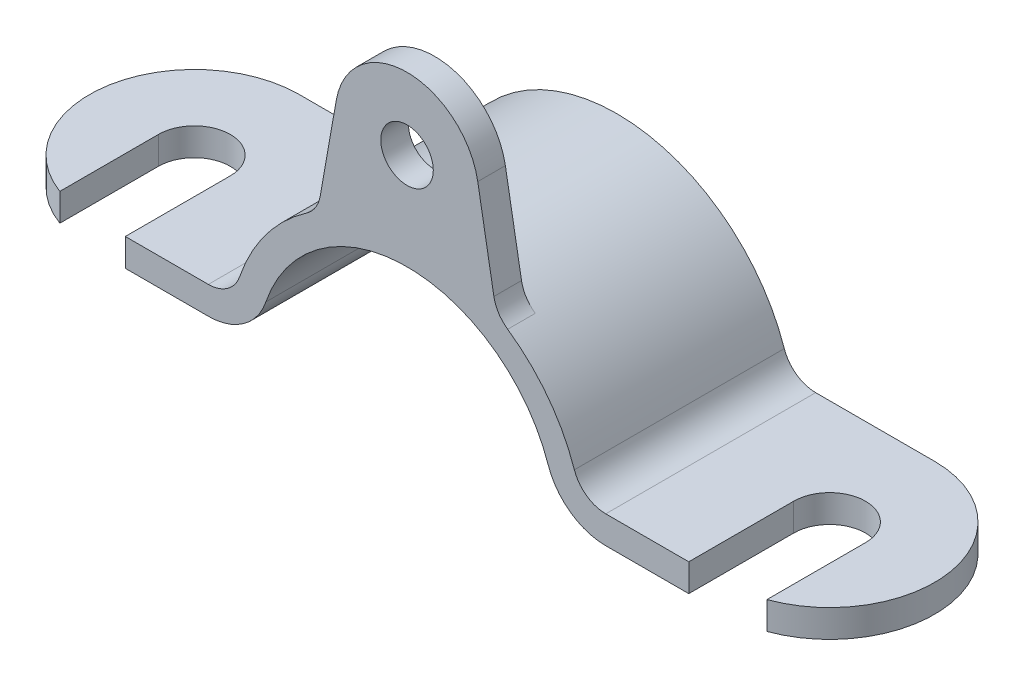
ISO-10303-21;
HEADER;
FILE_DESCRIPTION(('STEP AP214'),'2;1');
FILE_NAME('part.step','',(''),(''),'','','');
FILE_SCHEMA(('AUTOMOTIVE_DESIGN { 1 0 10303 214 1 1 1 1 }'));
ENDSEC;
DATA;
#1=APPLICATION_CONTEXT('core data for automotive mechanical design processes');
#2=APPLICATION_PROTOCOL_DEFINITION('international standard','automotive_design',2000,#1);
#3=PRODUCT_CONTEXT('',#1,'mechanical');
#4=PRODUCT('Part','Part','',(#3));
#5=PRODUCT_RELATED_PRODUCT_CATEGORY('part','',(#4));
#6=PRODUCT_DEFINITION_FORMATION('','',#4);
#7=PRODUCT_DEFINITION_CONTEXT('part definition',#1,'design');
#8=PRODUCT_DEFINITION('design','',#6,#7);
#9=PRODUCT_DEFINITION_SHAPE('','',#8);
#10=(LENGTH_UNIT() NAMED_UNIT(*) SI_UNIT(.MILLI.,.METRE.));
#11=(NAMED_UNIT(*) PLANE_ANGLE_UNIT() SI_UNIT($,.RADIAN.));
#12=(NAMED_UNIT(*) SI_UNIT($,.STERADIAN.) SOLID_ANGLE_UNIT());
#13=UNCERTAINTY_MEASURE_WITH_UNIT(LENGTH_MEASURE(1.E-05),#10,'distance_accuracy_value','');
#14=(GEOMETRIC_REPRESENTATION_CONTEXT(3) GLOBAL_UNCERTAINTY_ASSIGNED_CONTEXT((#13)) GLOBAL_UNIT_ASSIGNED_CONTEXT((#10,
#11,#12)) REPRESENTATION_CONTEXT('',''));
#15=CARTESIAN_POINT('',(0.,0.,0.));
#16=DIRECTION('',(0.,0.,1.));
#17=DIRECTION('',(1.,0.,0.));
#18=AXIS2_PLACEMENT_3D('',#15,#16,#17);
#19=CARTESIAN_POINT('',(57.5,-6.25,-19.));
#20=DIRECTION('',(0.,1.,0.));
#21=DIRECTION('',(-1.,0.,0.));
#22=AXIS2_PLACEMENT_3D('',#19,#20,#21);
#23=CYLINDRICAL_SURFACE('',#22,19.);
#24=DIRECTION('',(0.,1.,0.));
#25=VECTOR('',#24,1.);
#26=CARTESIAN_POINT('',(64.,-6.25,-1.14642892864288));
#27=LINE('',#26,#25);
#28=CARTESIAN_POINT('',(64.,1.25,-1.14642892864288));
#29=VERTEX_POINT('',#28);
#30=CARTESIAN_POINT('',(64.,6.25,-1.14642892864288));
#31=VERTEX_POINT('',#30);
#32=EDGE_CURVE('E224',#29,#31,#27,.T.);
#33=ORIENTED_EDGE('',*,*,#32,.F.);
#34=CARTESIAN_POINT('',(57.5,1.25,-19.));
#35=DIRECTION('',(0.,1.,0.));
#36=DIRECTION('',(0.,0.,1.));
#37=AXIS2_PLACEMENT_3D('',#34,#35,#36);
#38=CIRCLE('',#37,19.);
#39=CARTESIAN_POINT('',(57.5,1.25,-38.));
#40=VERTEX_POINT('',#39);
#41=EDGE_CURVE('E244',#40,#29,#38,.F.);
#42=ORIENTED_EDGE('',*,*,#41,.F.);
#43=DIRECTION('',(0.,-1.,0.));
#44=VECTOR('',#43,1.);
#45=CARTESIAN_POINT('',(57.5,-6.25,-38.));
#46=LINE('',#45,#44);
#47=CARTESIAN_POINT('',(57.5,6.25,-38.));
#48=VERTEX_POINT('',#47);
#49=EDGE_CURVE('E247',#48,#40,#46,.T.);
#50=ORIENTED_EDGE('',*,*,#49,.F.);
#51=CARTESIAN_POINT('',(57.5,6.25,-19.));
#52=DIRECTION('',(0.,1.,0.));
#53=DIRECTION('',(0.,0.,1.));
#54=AXIS2_PLACEMENT_3D('',#51,#52,#53);
#55=CIRCLE('',#54,19.);
#56=EDGE_CURVE('E275',#31,#48,#55,.T.);
#57=ORIENTED_EDGE('',*,*,#56,.F.);
#58=EDGE_LOOP('',(#33,#42,#50,#57));
#59=FACE_BOUND('',#58,.T.);
#60=ADVANCED_FACE('F34',(#59),#23,.T.);
#61=CARTESIAN_POINT('',(0.,0.,-38.));
#62=DIRECTION('',(0.,0.,1.));
#63=DIRECTION('',(1.,0.,0.));
#64=AXIS2_PLACEMENT_3D('',#61,#62,#63);
#65=PLANE('',#64);
#66=CARTESIAN_POINT('',(-35.9713427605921,12.25,-38.));
#67=DIRECTION('',(0.,0.,-1.));
#68=DIRECTION('',(1.,0.,0.));
#69=AXIS2_PLACEMENT_3D('',#66,#67,#68);
#70=CIRCLE('',#69,11.);
#71=CARTESIAN_POINT('',(-25.5585856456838,8.70394736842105,-38.));
#72=VERTEX_POINT('',#71);
#73=CARTESIAN_POINT('',(-35.9713427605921,1.25,-38.));
#74=VERTEX_POINT('',#73);
#75=EDGE_CURVE('E240',#72,#74,#70,.T.);
#76=ORIENTED_EDGE('',*,*,#75,.T.);
#77=DIRECTION('',(-1.,0.,0.));
#78=VECTOR('',#77,1.);
#79=CARTESIAN_POINT('',(-35.9713427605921,1.25,-38.));
#80=LINE('',#79,#78);
#81=CARTESIAN_POINT('',(-57.5,1.25,-38.));
#82=VERTEX_POINT('',#81);
#83=EDGE_CURVE('E360',#74,#82,#80,.T.);
#84=ORIENTED_EDGE('',*,*,#83,.T.);
#85=DIRECTION('',(0.,1.,0.));
#86=VECTOR('',#85,1.);
#87=CARTESIAN_POINT('',(-57.5,6.25,-38.));
#88=LINE('',#87,#86);
#89=CARTESIAN_POINT('',(-57.5,6.25,-38.));
#90=VERTEX_POINT('',#89);
#91=EDGE_CURVE('E254',#82,#90,#88,.T.);
#92=ORIENTED_EDGE('',*,*,#91,.T.);
#93=DIRECTION('',(-1.,0.,0.));
#94=VECTOR('',#93,1.);
#95=CARTESIAN_POINT('',(-31.3837139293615,6.25,-38.));
#96=LINE('',#95,#94);
#97=CARTESIAN_POINT('',(-35.9713427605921,6.25,-38.));
#98=VERTEX_POINT('',#97);
#99=EDGE_CURVE('E279',#98,#90,#96,.T.);
#100=ORIENTED_EDGE('',*,*,#99,.F.);
#101=CARTESIAN_POINT('',(-35.9713427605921,12.25,-38.));
#102=DIRECTION('',(0.,0.,1.));
#103=DIRECTION('',(1.,0.,0.));
#104=AXIS2_PLACEMENT_3D('',#101,#102,#103);
#105=CIRCLE('',#104,6.);
#106=CARTESIAN_POINT('',(-30.2916570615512,10.3157894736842,-38.));
#107=VERTEX_POINT('',#106);
#108=EDGE_CURVE('E248',#98,#107,#105,.T.);
#109=ORIENTED_EDGE('',*,*,#108,.T.);
#110=CARTESIAN_POINT('',(0.,0.,-38.));
#111=DIRECTION('',(0.,0.,1.));
#112=DIRECTION('',(1.,0.,0.));
#113=AXIS2_PLACEMENT_3D('',#110,#111,#112);
#114=CIRCLE('',#113,32.);
#115=CARTESIAN_POINT('',(30.2916570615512,10.3157894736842,-38.));
#116=VERTEX_POINT('',#115);
#117=EDGE_CURVE('E295',#116,#107,#114,.T.);
#118=ORIENTED_EDGE('',*,*,#117,.F.);
#119=CARTESIAN_POINT('',(35.9713427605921,12.25,-38.));
#120=DIRECTION('',(0.,0.,1.));
#121=DIRECTION('',(1.,0.,0.));
#122=AXIS2_PLACEMENT_3D('',#119,#120,#121);
#123=CIRCLE('',#122,6.);
#124=CARTESIAN_POINT('',(35.9713427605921,6.25,-38.));
#125=VERTEX_POINT('',#124);
#126=EDGE_CURVE('E245',#116,#125,#123,.T.);
#127=ORIENTED_EDGE('',*,*,#126,.T.);
#128=DIRECTION('',(-1.,0.,0.));
#129=VECTOR('',#128,1.);
#130=CARTESIAN_POINT('',(31.3837139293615,6.25,-38.));
#131=LINE('',#130,#129);
#132=EDGE_CURVE('E276',#48,#125,#131,.T.);
#133=ORIENTED_EDGE('',*,*,#132,.F.);
#134=ORIENTED_EDGE('',*,*,#49,.T.);
#135=DIRECTION('',(-1.,0.,0.));
#136=VECTOR('',#135,1.);
#137=CARTESIAN_POINT('',(76.5,1.25,-38.));
#138=LINE('',#137,#136);
#139=CARTESIAN_POINT('',(35.9713427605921,1.25,-38.));
#140=VERTEX_POINT('',#139);
#141=EDGE_CURVE('E370',#40,#140,#138,.T.);
#142=ORIENTED_EDGE('',*,*,#141,.T.);
#143=CARTESIAN_POINT('',(35.9713427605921,12.25,-38.));
#144=DIRECTION('',(0.,0.,-1.));
#145=DIRECTION('',(1.,0.,0.));
#146=AXIS2_PLACEMENT_3D('',#143,#144,#145);
#147=CIRCLE('',#146,11.);
#148=CARTESIAN_POINT('',(25.5585856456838,8.70394736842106,-38.));
#149=VERTEX_POINT('',#148);
#150=EDGE_CURVE('E367',#140,#149,#147,.T.);
#151=ORIENTED_EDGE('',*,*,#150,.T.);
#152=CARTESIAN_POINT('',(0.,0.,-38.));
#153=DIRECTION('',(0.,0.,1.));
#154=DIRECTION('',(1.,0.,0.));
#155=AXIS2_PLACEMENT_3D('',#152,#153,#154);
#156=CIRCLE('',#155,27.);
#157=EDGE_CURVE('E305',#149,#72,#156,.T.);
#158=ORIENTED_EDGE('',*,*,#157,.T.);
#159=EDGE_LOOP('',(#76,#84,#92,#100,#109,#118,#127,#133,#134,#142,#151,#158));
#160=FACE_BOUND('',#159,.T.);
#161=ADVANCED_FACE('F408',(#160),#65,.F.);
#162=CARTESIAN_POINT('',(0.,0.,0.));
#163=DIRECTION('',(0.,0.,1.));
#164=DIRECTION('',(1.,0.,0.));
#165=AXIS2_PLACEMENT_3D('',#162,#163,#164);
#166=PLANE('',#165);
#167=DIRECTION('',(0.,1.,0.));
#168=VECTOR('',#167,1.);
#169=CARTESIAN_POINT('',(-51.,-32.,0.));
#170=LINE('',#169,#168);
#171=CARTESIAN_POINT('',(-51.,1.25,0.));
#172=VERTEX_POINT('',#171);
#173=CARTESIAN_POINT('',(-51.,6.25,0.));
#174=VERTEX_POINT('',#173);
#175=EDGE_CURVE('E202',#172,#174,#170,.T.);
#176=ORIENTED_EDGE('',*,*,#175,.F.);
#177=DIRECTION('',(-1.,0.,0.));
#178=VECTOR('',#177,1.);
#179=CARTESIAN_POINT('',(-35.9713427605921,1.25,0.));
#180=LINE('',#179,#178);
#181=CARTESIAN_POINT('',(-35.9713427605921,1.25,0.));
#182=VERTEX_POINT('',#181);
#183=EDGE_CURVE('E351',#182,#172,#180,.T.);
#184=ORIENTED_EDGE('',*,*,#183,.F.);
#185=CARTESIAN_POINT('',(-35.9713427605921,12.25,0.));
#186=DIRECTION('',(0.,0.,-1.));
#187=DIRECTION('',(1.,0.,0.));
#188=AXIS2_PLACEMENT_3D('',#185,#186,#187);
#189=CIRCLE('',#188,11.);
#190=CARTESIAN_POINT('',(-25.5585856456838,8.70394736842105,0.));
#191=VERTEX_POINT('',#190);
#192=EDGE_CURVE('E349',#191,#182,#189,.T.);
#193=ORIENTED_EDGE('',*,*,#192,.F.);
#194=CARTESIAN_POINT('',(0.,0.,0.));
#195=DIRECTION('',(0.,0.,1.));
#196=DIRECTION('',(1.,0.,0.));
#197=AXIS2_PLACEMENT_3D('',#194,#195,#196);
#198=CIRCLE('',#197,27.);
#199=CARTESIAN_POINT('',(25.5585856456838,8.70394736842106,0.));
#200=VERTEX_POINT('',#199);
#201=EDGE_CURVE('E346',#200,#191,#198,.T.);
#202=ORIENTED_EDGE('',*,*,#201,.F.);
#203=CARTESIAN_POINT('',(35.9713427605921,12.25,0.));
#204=DIRECTION('',(0.,0.,-1.));
#205=DIRECTION('',(1.,0.,0.));
#206=AXIS2_PLACEMENT_3D('',#203,#204,#205);
#207=CIRCLE('',#206,11.);
#208=CARTESIAN_POINT('',(35.9713427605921,1.25,0.));
#209=VERTEX_POINT('',#208);
#210=EDGE_CURVE('E343',#209,#200,#207,.T.);
#211=ORIENTED_EDGE('',*,*,#210,.F.);
#212=DIRECTION('',(-1.,0.,0.));
#213=VECTOR('',#212,1.);
#214=CARTESIAN_POINT('',(0.,1.25,0.));
#215=LINE('',#214,#213);
#216=CARTESIAN_POINT('',(51.,1.25,0.));
#217=VERTEX_POINT('',#216);
#218=EDGE_CURVE('E241',#217,#209,#215,.T.);
#219=ORIENTED_EDGE('',*,*,#218,.F.);
#220=DIRECTION('',(0.,1.,0.));
#221=VECTOR('',#220,1.);
#222=CARTESIAN_POINT('',(51.,-32.,0.));
#223=LINE('',#222,#221);
#224=CARTESIAN_POINT('',(51.,6.25,0.));
#225=VERTEX_POINT('',#224);
#226=EDGE_CURVE('E58',#217,#225,#223,.T.);
#227=ORIENTED_EDGE('',*,*,#226,.T.);
#228=DIRECTION('',(-1.,0.,0.));
#229=VECTOR('',#228,1.);
#230=CARTESIAN_POINT('',(31.3837139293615,6.25,0.));
#231=LINE('',#230,#229);
#232=CARTESIAN_POINT('',(35.9713427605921,6.25,0.));
#233=VERTEX_POINT('',#232);
#234=EDGE_CURVE('E252',#225,#233,#231,.T.);
#235=ORIENTED_EDGE('',*,*,#234,.T.);
#236=CARTESIAN_POINT('',(35.9713427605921,12.25,0.));
#237=DIRECTION('',(0.,0.,1.));
#238=DIRECTION('',(1.,0.,0.));
#239=AXIS2_PLACEMENT_3D('',#236,#237,#238);
#240=CIRCLE('',#239,6.);
#241=CARTESIAN_POINT('',(30.2916570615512,10.3157894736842,0.));
#242=VERTEX_POINT('',#241);
#243=EDGE_CURVE('E249',#233,#242,#240,.F.);
#244=ORIENTED_EDGE('',*,*,#243,.T.);
#245=CARTESIAN_POINT('',(0.,0.,0.));
#246=DIRECTION('',(0.,0.,1.));
#247=DIRECTION('',(1.,0.,0.));
#248=AXIS2_PLACEMENT_3D('',#245,#246,#247);
#249=CIRCLE('',#248,32.);
#250=CARTESIAN_POINT('',(18.2153329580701,26.3097252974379,0.));
#251=VERTEX_POINT('',#250);
#252=EDGE_CURVE('E251',#242,#251,#249,.T.);
#253=ORIENTED_EDGE('',*,*,#252,.T.);
#254=CARTESIAN_POINT('',(21.6307078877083,31.2427987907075,0.));
#255=DIRECTION('',(0.,0.,1.));
#256=DIRECTION('',(1.,0.,0.));
#257=AXIS2_PLACEMENT_3D('',#254,#255,#256);
#258=CIRCLE('',#257,6.);
#259=CARTESIAN_POINT('',(15.721861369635,30.200909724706,0.));
#260=VERTEX_POINT('',#259);
#261=EDGE_CURVE('E264',#251,#260,#258,.F.);
#262=ORIENTED_EDGE('',*,*,#261,.T.);
#263=DIRECTION('',(-0.173648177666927,0.984807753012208,0.));
#264=VECTOR('',#263,1.);
#265=CARTESIAN_POINT('',(12.8025007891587,46.7574263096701,0.));
#266=LINE('',#265,#264);
#267=CARTESIAN_POINT('',(12.8025007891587,46.7574263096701,0.));
#268=VERTEX_POINT('',#267);
#269=EDGE_CURVE('E266',#260,#268,#266,.T.);
#270=ORIENTED_EDGE('',*,*,#269,.T.);
#271=CARTESIAN_POINT('',(0.,44.5,0.));
#272=DIRECTION('',(0.,0.,1.));
#273=DIRECTION('',(-1.,0.,0.));
#274=AXIS2_PLACEMENT_3D('',#271,#272,#273);
#275=CIRCLE('',#274,13.);
#276=CARTESIAN_POINT('',(-12.8025007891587,46.7574263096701,0.));
#277=VERTEX_POINT('',#276);
#278=EDGE_CURVE('E321',#268,#277,#275,.T.);
#279=ORIENTED_EDGE('',*,*,#278,.T.);
#280=DIRECTION('',(-0.173648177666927,-0.984807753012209,0.));
#281=VECTOR('',#280,1.);
#282=CARTESIAN_POINT('',(-16.1789319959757,27.6087333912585,0.));
#283=LINE('',#282,#281);
#284=CARTESIAN_POINT('',(-15.721861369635,30.200909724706,0.));
#285=VERTEX_POINT('',#284);
#286=EDGE_CURVE('E271',#277,#285,#283,.T.);
#287=ORIENTED_EDGE('',*,*,#286,.T.);
#288=CARTESIAN_POINT('',(-21.6307078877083,31.2427987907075,0.));
#289=DIRECTION('',(0.,0.,1.));
#290=DIRECTION('',(1.,0.,0.));
#291=AXIS2_PLACEMENT_3D('',#288,#289,#290);
#292=CIRCLE('',#291,6.);
#293=CARTESIAN_POINT('',(-18.2153329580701,26.3097252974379,0.));
#294=VERTEX_POINT('',#293);
#295=EDGE_CURVE('E269',#285,#294,#292,.F.);
#296=ORIENTED_EDGE('',*,*,#295,.T.);
#297=CARTESIAN_POINT('',(-30.2916570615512,10.3157894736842,0.));
#298=VERTEX_POINT('',#297);
#299=EDGE_CURVE('E258',#294,#298,#249,.T.);
#300=ORIENTED_EDGE('',*,*,#299,.T.);
#301=CARTESIAN_POINT('',(-35.9713427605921,12.25,0.));
#302=DIRECTION('',(0.,0.,1.));
#303=DIRECTION('',(1.,0.,0.));
#304=AXIS2_PLACEMENT_3D('',#301,#302,#303);
#305=CIRCLE('',#304,6.);
#306=CARTESIAN_POINT('',(-35.9713427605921,6.25,0.));
#307=VERTEX_POINT('',#306);
#308=EDGE_CURVE('E255',#298,#307,#305,.F.);
#309=ORIENTED_EDGE('',*,*,#308,.T.);
#310=DIRECTION('',(-1.,0.,0.));
#311=VECTOR('',#310,1.);
#312=CARTESIAN_POINT('',(-31.3837139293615,6.25,0.));
#313=LINE('',#312,#311);
#314=EDGE_CURVE('E257',#307,#174,#313,.T.);
#315=ORIENTED_EDGE('',*,*,#314,.T.);
#316=EDGE_LOOP('',(#176,#184,#193,#202,#211,#219,#227,#235,#244,#253,#262,#270,#279,#287,#296,
#300,#309,#315));
#317=FACE_BOUND('',#316,.T.);
#318=CARTESIAN_POINT('',(0.,44.5,0.));
#319=DIRECTION('',(0.,0.,1.));
#320=DIRECTION('',(1.,0.,0.));
#321=AXIS2_PLACEMENT_3D('',#318,#319,#320);
#322=CIRCLE('',#321,4.75);
#323=CARTESIAN_POINT('',(4.75,44.5,0.));
#324=VERTEX_POINT('',#323);
#325=EDGE_CURVE('E262',#324,#324,#322,.T.);
#326=ORIENTED_EDGE('',*,*,#325,.F.);
#327=EDGE_LOOP('',(#326));
#328=FACE_BOUND('',#327,.T.);
#329=ADVANCED_FACE('F392',(#317,#328),#166,.T.);
#330=CARTESIAN_POINT('',(-57.5,6.25,-19.));
#331=DIRECTION('',(0.,-1.,0.));
#332=DIRECTION('',(1.,0.,0.));
#333=AXIS2_PLACEMENT_3D('',#330,#331,#332);
#334=CYLINDRICAL_SURFACE('',#333,19.);
#335=DIRECTION('',(0.,-1.,0.));
#336=VECTOR('',#335,1.);
#337=CARTESIAN_POINT('',(-64.,6.25,-1.14642892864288));
#338=LINE('',#337,#336);
#339=CARTESIAN_POINT('',(-64.,6.25,-1.14642892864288));
#340=VERTEX_POINT('',#339);
#341=CARTESIAN_POINT('',(-64.,1.25,-1.14642892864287));
#342=VERTEX_POINT('',#341);
#343=EDGE_CURVE('E50',#340,#342,#338,.T.);
#344=ORIENTED_EDGE('',*,*,#343,.F.);
#345=CARTESIAN_POINT('',(-57.5,6.25,-19.));
#346=DIRECTION('',(0.,1.,0.));
#347=DIRECTION('',(0.,0.,1.));
#348=AXIS2_PLACEMENT_3D('',#345,#346,#347);
#349=CIRCLE('',#348,19.);
#350=EDGE_CURVE('E219',#90,#340,#349,.T.);
#351=ORIENTED_EDGE('',*,*,#350,.F.);
#352=ORIENTED_EDGE('',*,*,#91,.F.);
#353=CARTESIAN_POINT('',(-57.5,1.25,-19.));
#354=DIRECTION('',(0.,1.,0.));
#355=DIRECTION('',(0.,0.,1.));
#356=AXIS2_PLACEMENT_3D('',#353,#354,#355);
#357=CIRCLE('',#356,19.);
#358=EDGE_CURVE('E333',#342,#82,#357,.F.);
#359=ORIENTED_EDGE('',*,*,#358,.F.);
#360=EDGE_LOOP('',(#344,#351,#352,#359));
#361=FACE_BOUND('',#360,.T.);
#362=ADVANCED_FACE('F37',(#361),#334,.T.);
#363=CARTESIAN_POINT('',(0.,0.,-38.));
#364=DIRECTION('',(0.,0.,1.));
#365=DIRECTION('',(1.,0.,0.));
#366=AXIS2_PLACEMENT_3D('',#363,#364,#365);
#367=CYLINDRICAL_SURFACE('',#366,32.);
#368=ORIENTED_EDGE('',*,*,#299,.F.);
#369=DIRECTION('',(0.,0.,1.));
#370=VECTOR('',#369,1.);
#371=CARTESIAN_POINT('',(-18.2153329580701,26.3097252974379,-38.));
#372=LINE('',#371,#370);
#373=CARTESIAN_POINT('',(-18.2153329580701,26.3097252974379,-5.));
#374=VERTEX_POINT('',#373);
#375=EDGE_CURVE('E284',#294,#374,#372,.F.);
#376=ORIENTED_EDGE('',*,*,#375,.T.);
#377=CARTESIAN_POINT('',(0.,0.,-5.));
#378=DIRECTION('',(0.,0.,-1.));
#379=DIRECTION('',(1.,0.,0.));
#380=AXIS2_PLACEMENT_3D('',#377,#378,#379);
#381=CIRCLE('',#380,32.);
#382=CARTESIAN_POINT('',(18.2153329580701,26.3097252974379,-5.));
#383=VERTEX_POINT('',#382);
#384=EDGE_CURVE('E287',#374,#383,#381,.T.);
#385=ORIENTED_EDGE('',*,*,#384,.T.);
#386=DIRECTION('',(0.,0.,1.));
#387=VECTOR('',#386,1.);
#388=CARTESIAN_POINT('',(18.2153329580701,26.3097252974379,-38.));
#389=LINE('',#388,#387);
#390=EDGE_CURVE('E288',#383,#251,#389,.T.);
#391=ORIENTED_EDGE('',*,*,#390,.T.);
#392=ORIENTED_EDGE('',*,*,#252,.F.);
#393=DIRECTION('',(0.,0.,1.));
#394=VECTOR('',#393,1.);
#395=CARTESIAN_POINT('',(30.2916570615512,10.3157894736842,-38.));
#396=LINE('',#395,#394);
#397=EDGE_CURVE('E291',#242,#116,#396,.F.);
#398=ORIENTED_EDGE('',*,*,#397,.T.);
#399=ORIENTED_EDGE('',*,*,#117,.T.);
#400=DIRECTION('',(0.,0.,1.));
#401=VECTOR('',#400,1.);
#402=CARTESIAN_POINT('',(-30.2916570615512,10.3157894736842,-38.));
#403=LINE('',#402,#401);
#404=EDGE_CURVE('E292',#107,#298,#403,.T.);
#405=ORIENTED_EDGE('',*,*,#404,.T.);
#406=EDGE_LOOP('',(#368,#376,#385,#391,#392,#398,#399,#405));
#407=FACE_BOUND('',#406,.T.);
#408=ADVANCED_FACE('F401',(#407),#367,.T.);
#409=CARTESIAN_POINT('',(31.3837139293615,6.25,-38.));
#410=DIRECTION('',(0.,1.,0.));
#411=DIRECTION('',(0.,0.,1.));
#412=AXIS2_PLACEMENT_3D('',#409,#410,#411);
#413=PLANE('',#412);
#414=DIRECTION('',(0.,0.,-1.));
#415=VECTOR('',#414,1.);
#416=CARTESIAN_POINT('',(64.,6.25,-19.));
#417=LINE('',#416,#415);
#418=CARTESIAN_POINT('',(64.,6.25,-19.));
#419=VERTEX_POINT('',#418);
#420=EDGE_CURVE('E231',#31,#419,#417,.T.);
#421=ORIENTED_EDGE('',*,*,#420,.F.);
#422=ORIENTED_EDGE('',*,*,#56,.T.);
#423=ORIENTED_EDGE('',*,*,#132,.T.);
#424=DIRECTION('',(0.,0.,-1.));
#425=VECTOR('',#424,1.);
#426=CARTESIAN_POINT('',(35.9713427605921,6.25,0.));
#427=LINE('',#426,#425);
#428=EDGE_CURVE('E272',#125,#233,#427,.F.);
#429=ORIENTED_EDGE('',*,*,#428,.T.);
#430=ORIENTED_EDGE('',*,*,#234,.F.);
#431=DIRECTION('',(0.,0.,1.));
#432=VECTOR('',#431,1.);
#433=CARTESIAN_POINT('',(51.,6.25,-19.));
#434=LINE('',#433,#432);
#435=CARTESIAN_POINT('',(51.,6.25,-19.));
#436=VERTEX_POINT('',#435);
#437=EDGE_CURVE('E229',#436,#225,#434,.T.);
#438=ORIENTED_EDGE('',*,*,#437,.F.);
#439=CARTESIAN_POINT('',(57.5,6.25,-19.));
#440=DIRECTION('',(0.,1.,0.));
#441=DIRECTION('',(0.,0.,1.));
#442=AXIS2_PLACEMENT_3D('',#439,#440,#441);
#443=CIRCLE('',#442,6.50000000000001);
#444=EDGE_CURVE('E226',#419,#436,#443,.T.);
#445=ORIENTED_EDGE('',*,*,#444,.F.);
#446=EDGE_LOOP('',(#421,#422,#423,#429,#430,#438,#445));
#447=FACE_BOUND('',#446,.T.);
#448=ADVANCED_FACE('F418',(#447),#413,.T.);
#449=CARTESIAN_POINT('',(-31.3837139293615,6.25,-38.));
#450=DIRECTION('',(0.,1.,0.));
#451=DIRECTION('',(0.,0.,1.));
#452=AXIS2_PLACEMENT_3D('',#449,#450,#451);
#453=PLANE('',#452);
#454=DIRECTION('',(0.,0.,-1.));
#455=VECTOR('',#454,1.);
#456=CARTESIAN_POINT('',(-51.,6.25,-19.));
#457=LINE('',#456,#455);
#458=CARTESIAN_POINT('',(-51.,6.25,-19.));
#459=VERTEX_POINT('',#458);
#460=EDGE_CURVE('E203',#174,#459,#457,.T.);
#461=ORIENTED_EDGE('',*,*,#460,.F.);
#462=ORIENTED_EDGE('',*,*,#314,.F.);
#463=DIRECTION('',(0.,0.,-1.));
#464=VECTOR('',#463,1.);
#465=CARTESIAN_POINT('',(-35.9713427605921,6.25,-38.));
#466=LINE('',#465,#464);
#467=EDGE_CURVE('E277',#307,#98,#466,.T.);
#468=ORIENTED_EDGE('',*,*,#467,.T.);
#469=ORIENTED_EDGE('',*,*,#99,.T.);
#470=ORIENTED_EDGE('',*,*,#350,.T.);
#471=DIRECTION('',(0.,0.,1.));
#472=VECTOR('',#471,1.);
#473=CARTESIAN_POINT('',(-64.,6.25,-19.));
#474=LINE('',#473,#472);
#475=CARTESIAN_POINT('',(-64.,6.25,-19.));
#476=VERTEX_POINT('',#475);
#477=EDGE_CURVE('E198',#476,#340,#474,.T.);
#478=ORIENTED_EDGE('',*,*,#477,.F.);
#479=CARTESIAN_POINT('',(-57.5,6.25,-19.));
#480=DIRECTION('',(0.,1.,0.));
#481=DIRECTION('',(0.,0.,1.));
#482=AXIS2_PLACEMENT_3D('',#479,#480,#481);
#483=CIRCLE('',#482,6.50000000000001);
#484=EDGE_CURVE('E206',#459,#476,#483,.T.);
#485=ORIENTED_EDGE('',*,*,#484,.F.);
#486=EDGE_LOOP('',(#461,#462,#468,#469,#470,#478,#485));
#487=FACE_BOUND('',#486,.T.);
#488=ADVANCED_FACE('F216',(#487),#453,.T.);
#489=CARTESIAN_POINT('',(-16.1789319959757,27.6087333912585,-5.));
#490=DIRECTION('',(-0.984807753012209,0.173648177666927,0.));
#491=DIRECTION('',(-0.173648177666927,-0.984807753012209,0.));
#492=AXIS2_PLACEMENT_3D('',#489,#490,#491);
#493=PLANE('',#492);
#494=DIRECTION('',(-0.173648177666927,-0.984807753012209,0.));
#495=VECTOR('',#494,1.);
#496=CARTESIAN_POINT('',(-16.1789319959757,27.6087333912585,-5.));
#497=LINE('',#496,#495);
#498=CARTESIAN_POINT('',(-12.8025007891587,46.7574263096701,-5.));
#499=VERTEX_POINT('',#498);
#500=CARTESIAN_POINT('',(-15.721861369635,30.200909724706,-5.));
#501=VERTEX_POINT('',#500);
#502=EDGE_CURVE('E301',#499,#501,#497,.T.);
#503=ORIENTED_EDGE('',*,*,#502,.T.);
#504=DIRECTION('',(0.,0.,-1.));
#505=VECTOR('',#504,1.);
#506=CARTESIAN_POINT('',(-15.721861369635,30.200909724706,0.));
#507=LINE('',#506,#505);
#508=EDGE_CURVE('E297',#501,#285,#507,.F.);
#509=ORIENTED_EDGE('',*,*,#508,.T.);
#510=ORIENTED_EDGE('',*,*,#286,.F.);
#511=DIRECTION('',(0.,0.,1.));
#512=VECTOR('',#511,1.);
#513=CARTESIAN_POINT('',(-12.8025007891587,46.7574263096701,-5.));
#514=LINE('',#513,#512);
#515=EDGE_CURVE('E283',#499,#277,#514,.T.);
#516=ORIENTED_EDGE('',*,*,#515,.F.);
#517=EDGE_LOOP('',(#503,#509,#510,#516));
#518=FACE_BOUND('',#517,.T.);
#519=ADVANCED_FACE('F480',(#518),#493,.T.);
#520=CARTESIAN_POINT('',(0.,44.5,-5.));
#521=DIRECTION('',(0.,0.,1.));
#522=DIRECTION('',(1.,0.,0.));
#523=AXIS2_PLACEMENT_3D('',#520,#521,#522);
#524=CYLINDRICAL_SURFACE('',#523,13.);
#525=ORIENTED_EDGE('',*,*,#278,.F.);
#526=DIRECTION('',(0.,0.,1.));
#527=VECTOR('',#526,1.);
#528=CARTESIAN_POINT('',(12.8025007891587,46.7574263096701,-5.));
#529=LINE('',#528,#527);
#530=CARTESIAN_POINT('',(12.8025007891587,46.7574263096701,-5.));
#531=VERTEX_POINT('',#530);
#532=EDGE_CURVE('E315',#531,#268,#529,.T.);
#533=ORIENTED_EDGE('',*,*,#532,.F.);
#534=CARTESIAN_POINT('',(0.,44.5,-5.));
#535=DIRECTION('',(0.,0.,1.));
#536=DIRECTION('',(-1.,0.,0.));
#537=AXIS2_PLACEMENT_3D('',#534,#535,#536);
#538=CIRCLE('',#537,13.);
#539=EDGE_CURVE('E300',#531,#499,#538,.T.);
#540=ORIENTED_EDGE('',*,*,#539,.T.);
#541=ORIENTED_EDGE('',*,*,#515,.T.);
#542=EDGE_LOOP('',(#525,#533,#540,#541));
#543=FACE_BOUND('',#542,.T.);
#544=ADVANCED_FACE('F483',(#543),#524,.T.);
#545=CARTESIAN_POINT('',(12.8025007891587,46.7574263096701,-5.));
#546=DIRECTION('',(0.984807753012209,0.173648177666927,0.));
#547=DIRECTION('',(-0.173648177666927,0.984807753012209,0.));
#548=AXIS2_PLACEMENT_3D('',#545,#546,#547);
#549=PLANE('',#548);
#550=ORIENTED_EDGE('',*,*,#269,.F.);
#551=DIRECTION('',(0.,0.,-1.));
#552=VECTOR('',#551,1.);
#553=CARTESIAN_POINT('',(15.721861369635,30.200909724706,-5.));
#554=LINE('',#553,#552);
#555=CARTESIAN_POINT('',(15.721861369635,30.200909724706,-5.));
#556=VERTEX_POINT('',#555);
#557=EDGE_CURVE('E280',#260,#556,#554,.T.);
#558=ORIENTED_EDGE('',*,*,#557,.T.);
#559=DIRECTION('',(-0.173648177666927,0.984807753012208,0.));
#560=VECTOR('',#559,1.);
#561=CARTESIAN_POINT('',(12.8025007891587,46.7574263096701,-5.));
#562=LINE('',#561,#560);
#563=EDGE_CURVE('E282',#556,#531,#562,.T.);
#564=ORIENTED_EDGE('',*,*,#563,.T.);
#565=ORIENTED_EDGE('',*,*,#532,.T.);
#566=EDGE_LOOP('',(#550,#558,#564,#565));
#567=FACE_BOUND('',#566,.T.);
#568=ADVANCED_FACE('F478',(#567),#549,.T.);
#569=CARTESIAN_POINT('',(0.,0.,-5.));
#570=DIRECTION('',(0.,0.,1.));
#571=DIRECTION('',(1.,0.,0.));
#572=AXIS2_PLACEMENT_3D('',#569,#570,#571);
#573=PLANE('',#572);
#574=CARTESIAN_POINT('',(0.,44.5,-5.));
#575=DIRECTION('',(0.,0.,1.));
#576=DIRECTION('',(1.,0.,0.));
#577=AXIS2_PLACEMENT_3D('',#574,#575,#576);
#578=CIRCLE('',#577,4.75);
#579=CARTESIAN_POINT('',(4.75,44.5,-5.));
#580=VERTEX_POINT('',#579);
#581=EDGE_CURVE('E268',#580,#580,#578,.T.);
#582=ORIENTED_EDGE('',*,*,#581,.T.);
#583=EDGE_LOOP('',(#582));
#584=FACE_BOUND('',#583,.T.);
#585=ORIENTED_EDGE('',*,*,#384,.F.);
#586=CARTESIAN_POINT('',(-21.6307078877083,31.2427987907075,-5.));
#587=DIRECTION('',(0.,0.,1.));
#588=DIRECTION('',(1.,0.,0.));
#589=AXIS2_PLACEMENT_3D('',#586,#587,#588);
#590=CIRCLE('',#589,6.);
#591=EDGE_CURVE('E263',#374,#501,#590,.T.);
#592=ORIENTED_EDGE('',*,*,#591,.T.);
#593=ORIENTED_EDGE('',*,*,#502,.F.);
#594=ORIENTED_EDGE('',*,*,#539,.F.);
#595=ORIENTED_EDGE('',*,*,#563,.F.);
#596=CARTESIAN_POINT('',(21.6307078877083,31.2427987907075,-5.));
#597=DIRECTION('',(0.,0.,1.));
#598=DIRECTION('',(1.,0.,0.));
#599=AXIS2_PLACEMENT_3D('',#596,#597,#598);
#600=CIRCLE('',#599,6.);
#601=EDGE_CURVE('E259',#556,#383,#600,.T.);
#602=ORIENTED_EDGE('',*,*,#601,.T.);
#603=EDGE_LOOP('',(#585,#592,#593,#594,#595,#602));
#604=FACE_BOUND('',#603,.T.);
#605=ADVANCED_FACE('F474',(#584,#604),#573,.F.);
#606=CARTESIAN_POINT('',(0.,44.5,-5.));
#607=DIRECTION('',(0.,0.,1.));
#608=DIRECTION('',(1.,0.,0.));
#609=AXIS2_PLACEMENT_3D('',#606,#607,#608);
#610=CYLINDRICAL_SURFACE('',#609,4.75);
#611=ORIENTED_EDGE('',*,*,#581,.F.);
#612=EDGE_LOOP('',(#611));
#613=FACE_BOUND('',#612,.T.);
#614=ORIENTED_EDGE('',*,*,#325,.T.);
#615=EDGE_LOOP('',(#614));
#616=FACE_BOUND('',#615,.T.);
#617=ADVANCED_FACE('F470',(#613,#616),#610,.F.);
#618=CARTESIAN_POINT('',(-21.6307078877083,31.2427987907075,-38.));
#619=DIRECTION('',(0.,0.,1.));
#620=DIRECTION('',(1.,0.,0.));
#621=AXIS2_PLACEMENT_3D('',#618,#619,#620);
#622=CYLINDRICAL_SURFACE('',#621,6.);
#623=ORIENTED_EDGE('',*,*,#591,.F.);
#624=ORIENTED_EDGE('',*,*,#375,.F.);
#625=ORIENTED_EDGE('',*,*,#295,.F.);
#626=ORIENTED_EDGE('',*,*,#508,.F.);
#627=EDGE_LOOP('',(#623,#624,#625,#626));
#628=FACE_BOUND('',#627,.T.);
#629=ADVANCED_FACE('F473',(#628),#622,.F.);
#630=CARTESIAN_POINT('',(21.6307078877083,31.2427987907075,-38.));
#631=DIRECTION('',(0.,0.,1.));
#632=DIRECTION('',(1.,0.,0.));
#633=AXIS2_PLACEMENT_3D('',#630,#631,#632);
#634=CYLINDRICAL_SURFACE('',#633,6.);
#635=ORIENTED_EDGE('',*,*,#601,.F.);
#636=ORIENTED_EDGE('',*,*,#557,.F.);
#637=ORIENTED_EDGE('',*,*,#261,.F.);
#638=ORIENTED_EDGE('',*,*,#390,.F.);
#639=EDGE_LOOP('',(#635,#636,#637,#638));
#640=FACE_BOUND('',#639,.T.);
#641=ADVANCED_FACE('F497',(#640),#634,.F.);
#642=CARTESIAN_POINT('',(-35.9713427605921,12.25,-38.));
#643=DIRECTION('',(0.,0.,1.));
#644=DIRECTION('',(1.,0.,0.));
#645=AXIS2_PLACEMENT_3D('',#642,#643,#644);
#646=CYLINDRICAL_SURFACE('',#645,6.);
#647=ORIENTED_EDGE('',*,*,#108,.F.);
#648=ORIENTED_EDGE('',*,*,#467,.F.);
#649=ORIENTED_EDGE('',*,*,#308,.F.);
#650=ORIENTED_EDGE('',*,*,#404,.F.);
#651=EDGE_LOOP('',(#647,#648,#649,#650));
#652=FACE_BOUND('',#651,.T.);
#653=ADVANCED_FACE('F399',(#652),#646,.F.);
#654=CARTESIAN_POINT('',(35.9713427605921,12.25,-38.));
#655=DIRECTION('',(0.,0.,1.));
#656=DIRECTION('',(1.,0.,0.));
#657=AXIS2_PLACEMENT_3D('',#654,#655,#656);
#658=CYLINDRICAL_SURFACE('',#657,6.);
#659=ORIENTED_EDGE('',*,*,#126,.F.);
#660=ORIENTED_EDGE('',*,*,#397,.F.);
#661=ORIENTED_EDGE('',*,*,#243,.F.);
#662=ORIENTED_EDGE('',*,*,#428,.F.);
#663=EDGE_LOOP('',(#659,#660,#661,#662));
#664=FACE_BOUND('',#663,.T.);
#665=ADVANCED_FACE('F413',(#664),#658,.F.);
#666=CARTESIAN_POINT('',(-35.9713427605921,1.25,-38.));
#667=DIRECTION('',(0.,1.,0.));
#668=DIRECTION('',(0.,0.,1.));
#669=AXIS2_PLACEMENT_3D('',#666,#667,#668);
#670=PLANE('',#669);
#671=ORIENTED_EDGE('',*,*,#183,.T.);
#672=DIRECTION('',(0.,0.,-1.));
#673=VECTOR('',#672,1.);
#674=CARTESIAN_POINT('',(-51.,1.25,-38.));
#675=LINE('',#674,#673);
#676=CARTESIAN_POINT('',(-51.,1.25,-19.));
#677=VERTEX_POINT('',#676);
#678=EDGE_CURVE('E11',#172,#677,#675,.T.);
#679=ORIENTED_EDGE('',*,*,#678,.T.);
#680=CARTESIAN_POINT('',(-57.5,1.25,-19.));
#681=DIRECTION('',(0.,1.,0.));
#682=DIRECTION('',(0.,0.,1.));
#683=AXIS2_PLACEMENT_3D('',#680,#681,#682);
#684=CIRCLE('',#683,6.50000000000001);
#685=CARTESIAN_POINT('',(-64.,1.25,-19.));
#686=VERTEX_POINT('',#685);
#687=EDGE_CURVE('E43',#677,#686,#684,.T.);
#688=ORIENTED_EDGE('',*,*,#687,.T.);
#689=DIRECTION('',(0.,0.,1.));
#690=VECTOR('',#689,1.);
#691=CARTESIAN_POINT('',(-64.,1.25,-38.));
#692=LINE('',#691,#690);
#693=EDGE_CURVE('E199',#686,#342,#692,.T.);
#694=ORIENTED_EDGE('',*,*,#693,.T.);
#695=ORIENTED_EDGE('',*,*,#358,.T.);
#696=ORIENTED_EDGE('',*,*,#83,.F.);
#697=DIRECTION('',(0.,0.,1.));
#698=VECTOR('',#697,1.);
#699=CARTESIAN_POINT('',(-35.9713427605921,1.25,-38.));
#700=LINE('',#699,#698);
#701=EDGE_CURVE('E337',#74,#182,#700,.T.);
#702=ORIENTED_EDGE('',*,*,#701,.T.);
#703=EDGE_LOOP('',(#671,#679,#688,#694,#695,#696,#702));
#704=FACE_BOUND('',#703,.T.);
#705=ADVANCED_FACE('F384',(#704),#670,.F.);
#706=CARTESIAN_POINT('',(-35.9713427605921,12.25,-38.));
#707=DIRECTION('',(0.,0.,1.));
#708=DIRECTION('',(1.,0.,0.));
#709=AXIS2_PLACEMENT_3D('',#706,#707,#708);
#710=CYLINDRICAL_SURFACE('',#709,11.);
#711=ORIENTED_EDGE('',*,*,#192,.T.);
#712=ORIENTED_EDGE('',*,*,#701,.F.);
#713=ORIENTED_EDGE('',*,*,#75,.F.);
#714=DIRECTION('',(0.,0.,1.));
#715=VECTOR('',#714,1.);
#716=CARTESIAN_POINT('',(-25.5585856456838,8.70394736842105,-38.));
#717=LINE('',#716,#715);
#718=EDGE_CURVE('E347',#72,#191,#717,.T.);
#719=ORIENTED_EDGE('',*,*,#718,.T.);
#720=EDGE_LOOP('',(#711,#712,#713,#719));
#721=FACE_BOUND('',#720,.T.);
#722=ADVANCED_FACE('F439',(#721),#710,.T.);
#723=CARTESIAN_POINT('',(0.,0.,-38.));
#724=DIRECTION('',(0.,0.,1.));
#725=DIRECTION('',(1.,0.,0.));
#726=AXIS2_PLACEMENT_3D('',#723,#724,#725);
#727=CYLINDRICAL_SURFACE('',#726,27.);
#728=ORIENTED_EDGE('',*,*,#201,.T.);
#729=ORIENTED_EDGE('',*,*,#718,.F.);
#730=ORIENTED_EDGE('',*,*,#157,.F.);
#731=DIRECTION('',(0.,0.,1.));
#732=VECTOR('',#731,1.);
#733=CARTESIAN_POINT('',(25.5585856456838,8.70394736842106,-38.));
#734=LINE('',#733,#732);
#735=EDGE_CURVE('E344',#149,#200,#734,.T.);
#736=ORIENTED_EDGE('',*,*,#735,.T.);
#737=EDGE_LOOP('',(#728,#729,#730,#736));
#738=FACE_BOUND('',#737,.T.);
#739=ADVANCED_FACE('F435',(#738),#727,.F.);
#740=CARTESIAN_POINT('',(35.9713427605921,12.25,-38.));
#741=DIRECTION('',(0.,0.,1.));
#742=DIRECTION('',(1.,0.,0.));
#743=AXIS2_PLACEMENT_3D('',#740,#741,#742);
#744=CYLINDRICAL_SURFACE('',#743,11.);
#745=ORIENTED_EDGE('',*,*,#210,.T.);
#746=ORIENTED_EDGE('',*,*,#735,.F.);
#747=ORIENTED_EDGE('',*,*,#150,.F.);
#748=DIRECTION('',(0.,0.,1.));
#749=VECTOR('',#748,1.);
#750=CARTESIAN_POINT('',(35.9713427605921,1.25,-38.));
#751=LINE('',#750,#749);
#752=EDGE_CURVE('E340',#140,#209,#751,.T.);
#753=ORIENTED_EDGE('',*,*,#752,.T.);
#754=EDGE_LOOP('',(#745,#746,#747,#753));
#755=FACE_BOUND('',#754,.T.);
#756=ADVANCED_FACE('F431',(#755),#744,.T.);
#757=CARTESIAN_POINT('',(76.5,1.25,-38.));
#758=DIRECTION('',(0.,1.,0.));
#759=DIRECTION('',(0.,0.,1.));
#760=AXIS2_PLACEMENT_3D('',#757,#758,#759);
#761=PLANE('',#760);
#762=ORIENTED_EDGE('',*,*,#41,.T.);
#763=DIRECTION('',(0.,0.,-1.));
#764=VECTOR('',#763,1.);
#765=CARTESIAN_POINT('',(64.,1.25,-38.));
#766=LINE('',#765,#764);
#767=CARTESIAN_POINT('',(64.,1.25,-19.));
#768=VERTEX_POINT('',#767);
#769=EDGE_CURVE('E380',#29,#768,#766,.T.);
#770=ORIENTED_EDGE('',*,*,#769,.T.);
#771=CARTESIAN_POINT('',(57.5,1.25,-19.));
#772=DIRECTION('',(0.,1.,0.));
#773=DIRECTION('',(0.,0.,1.));
#774=AXIS2_PLACEMENT_3D('',#771,#772,#773);
#775=CIRCLE('',#774,6.50000000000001);
#776=CARTESIAN_POINT('',(51.,1.25,-19.));
#777=VERTEX_POINT('',#776);
#778=EDGE_CURVE('E377',#768,#777,#775,.T.);
#779=ORIENTED_EDGE('',*,*,#778,.T.);
#780=DIRECTION('',(0.,0.,1.));
#781=VECTOR('',#780,1.);
#782=CARTESIAN_POINT('',(51.,1.25,-38.));
#783=LINE('',#782,#781);
#784=EDGE_CURVE('E243',#777,#217,#783,.T.);
#785=ORIENTED_EDGE('',*,*,#784,.T.);
#786=ORIENTED_EDGE('',*,*,#218,.T.);
#787=ORIENTED_EDGE('',*,*,#752,.F.);
#788=ORIENTED_EDGE('',*,*,#141,.F.);
#789=EDGE_LOOP('',(#762,#770,#779,#785,#786,#787,#788));
#790=FACE_BOUND('',#789,.T.);
#791=ADVANCED_FACE('F426',(#790),#761,.F.);
#792=CARTESIAN_POINT('',(57.5,-32.,-19.));
#793=DIRECTION('',(0.,1.,0.));
#794=DIRECTION('',(0.,0.,1.));
#795=AXIS2_PLACEMENT_3D('',#792,#793,#794);
#796=CYLINDRICAL_SURFACE('',#795,6.50000000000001);
#797=DIRECTION('',(0.,1.,0.));
#798=VECTOR('',#797,1.);
#799=CARTESIAN_POINT('',(64.,-32.,-19.));
#800=LINE('',#799,#798);
#801=EDGE_CURVE('E213',#768,#419,#800,.T.);
#802=ORIENTED_EDGE('',*,*,#801,.T.);
#803=ORIENTED_EDGE('',*,*,#444,.T.);
#804=DIRECTION('',(0.,1.,0.));
#805=VECTOR('',#804,1.);
#806=CARTESIAN_POINT('',(51.,-32.,-19.));
#807=LINE('',#806,#805);
#808=EDGE_CURVE('E234',#777,#436,#807,.T.);
#809=ORIENTED_EDGE('',*,*,#808,.F.);
#810=ORIENTED_EDGE('',*,*,#778,.F.);
#811=EDGE_LOOP('',(#802,#803,#809,#810));
#812=FACE_BOUND('',#811,.T.);
#813=ADVANCED_FACE('F469',(#812),#796,.F.);
#814=CARTESIAN_POINT('',(51.,-32.,-19.));
#815=DIRECTION('',(-1.,0.,0.));
#816=DIRECTION('',(0.,0.,1.));
#817=AXIS2_PLACEMENT_3D('',#814,#815,#816);
#818=PLANE('',#817);
#819=ORIENTED_EDGE('',*,*,#808,.T.);
#820=ORIENTED_EDGE('',*,*,#437,.T.);
#821=ORIENTED_EDGE('',*,*,#226,.F.);
#822=ORIENTED_EDGE('',*,*,#784,.F.);
#823=EDGE_LOOP('',(#819,#820,#821,#822));
#824=FACE_BOUND('',#823,.T.);
#825=ADVANCED_FACE('F508',(#824),#818,.F.);
#826=CARTESIAN_POINT('',(64.,-32.,-19.));
#827=DIRECTION('',(1.,0.,0.));
#828=DIRECTION('',(0.,0.,-1.));
#829=AXIS2_PLACEMENT_3D('',#826,#827,#828);
#830=PLANE('',#829);
#831=ORIENTED_EDGE('',*,*,#32,.T.);
#832=ORIENTED_EDGE('',*,*,#420,.T.);
#833=ORIENTED_EDGE('',*,*,#801,.F.);
#834=ORIENTED_EDGE('',*,*,#769,.F.);
#835=EDGE_LOOP('',(#831,#832,#833,#834));
#836=FACE_BOUND('',#835,.T.);
#837=ADVANCED_FACE('F512',(#836),#830,.F.);
#838=CARTESIAN_POINT('',(-57.5,-32.,-19.));
#839=DIRECTION('',(0.,1.,0.));
#840=DIRECTION('',(0.,0.,1.));
#841=AXIS2_PLACEMENT_3D('',#838,#839,#840);
#842=CYLINDRICAL_SURFACE('',#841,6.50000000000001);
#843=DIRECTION('',(0.,1.,0.));
#844=VECTOR('',#843,1.);
#845=CARTESIAN_POINT('',(-51.,-32.,-19.));
#846=LINE('',#845,#844);
#847=EDGE_CURVE('E209',#677,#459,#846,.T.);
#848=ORIENTED_EDGE('',*,*,#847,.T.);
#849=ORIENTED_EDGE('',*,*,#484,.T.);
#850=DIRECTION('',(0.,1.,0.));
#851=VECTOR('',#850,1.);
#852=CARTESIAN_POINT('',(-64.,-32.,-19.));
#853=LINE('',#852,#851);
#854=EDGE_CURVE('E194',#686,#476,#853,.T.);
#855=ORIENTED_EDGE('',*,*,#854,.F.);
#856=ORIENTED_EDGE('',*,*,#687,.F.);
#857=EDGE_LOOP('',(#848,#849,#855,#856));
#858=FACE_BOUND('',#857,.T.);
#859=ADVANCED_FACE('F207',(#858),#842,.F.);
#860=CARTESIAN_POINT('',(-51.,-32.,-19.));
#861=DIRECTION('',(1.,0.,0.));
#862=DIRECTION('',(0.,0.,-1.));
#863=AXIS2_PLACEMENT_3D('',#860,#861,#862);
#864=PLANE('',#863);
#865=ORIENTED_EDGE('',*,*,#175,.T.);
#866=ORIENTED_EDGE('',*,*,#460,.T.);
#867=ORIENTED_EDGE('',*,*,#847,.F.);
#868=ORIENTED_EDGE('',*,*,#678,.F.);
#869=EDGE_LOOP('',(#865,#866,#867,#868));
#870=FACE_BOUND('',#869,.T.);
#871=ADVANCED_FACE('F387',(#870),#864,.F.);
#872=CARTESIAN_POINT('',(-64.,-32.,-19.));
#873=DIRECTION('',(-1.,0.,0.));
#874=DIRECTION('',(0.,0.,1.));
#875=AXIS2_PLACEMENT_3D('',#872,#873,#874);
#876=PLANE('',#875);
#877=ORIENTED_EDGE('',*,*,#343,.T.);
#878=ORIENTED_EDGE('',*,*,#693,.F.);
#879=ORIENTED_EDGE('',*,*,#854,.T.);
#880=ORIENTED_EDGE('',*,*,#477,.T.);
#881=EDGE_LOOP('',(#877,#878,#879,#880));
#882=FACE_BOUND('',#881,.T.);
#883=ADVANCED_FACE('F196',(#882),#876,.F.);
#884=CLOSED_SHELL('',(#60,#161,#329,#362,#408,#448,#488,#519,#544,#568,#605,#617,#629,#641,#653,
#665,#705,#722,#739,#756,#791,#813,#825,#837,#859,#871,#883));
#885=MANIFOLD_SOLID_BREP('B2',#884);
#886=ADVANCED_BREP_SHAPE_REPRESENTATION('',(#18,#885),#14);
#887=SHAPE_DEFINITION_REPRESENTATION(#9,#886);
ENDSEC;
END-ISO-10303-21;
